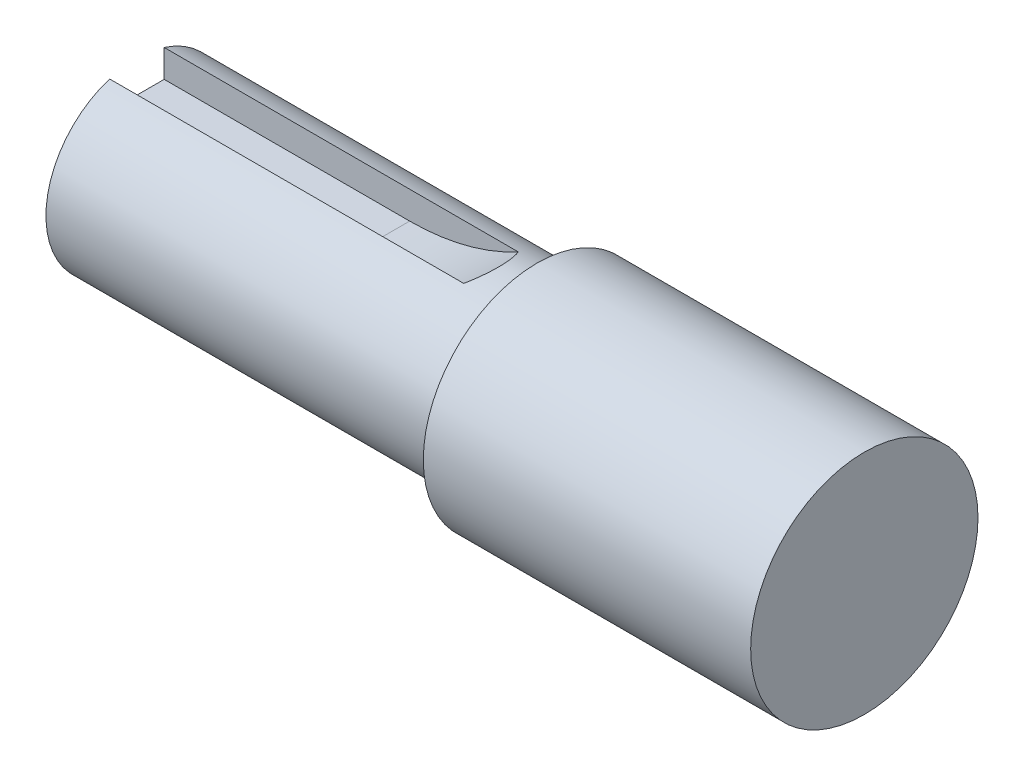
from build123d import *

# Parameters (mm, degrees)
ESQUISSE2_W             = 6
ESQUISSE2_H             = 3.5
ENL_V_MAT_EXTRU_1_DEPTH = 27
ESQUISSE3_R             = 25
ENL_V_MAT_EXTRU_2_DEPTH = 6
PER_AGE1_D              = 6.8
PER_AGE1_DEPTH          = 36
PER_AGE1_CBORE_D        = 8
PER_AGE1_CBORE_DEPTH    = 30
PER_AGE1_TIP            = 2.042926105


with BuildPart() as part:
    # Esquisse1 → Base-R_volution (revolve)
    with BuildSketch(Plane.XY, mode=Mode.PRIVATE) as base_r_volution_sk:
        Polygon((0, 12.5), (36, 12.5), (36, 0), (-44, 0), (-44, 10), (0, 10), align=None)
    revolve(base_r_volution_sk.sketch.rotate(Axis((-70, 0, 0), (1, 0, 0)), 90), axis=Axis((-70, 0, 0), (1, 0, 0)))

    # Esquisse2 → Enl_v. mat.-Extru.1 (cut)
    with BuildSketch(Plane.ZY.offset(44)):
        with Locations((0, 8.25)):
            Rectangle(ESQUISSE2_W, ESQUISSE2_H)
    extrude(amount=-ENL_V_MAT_EXTRU_1_DEPTH, mode=Mode.SUBTRACT)

    # Esquisse3 → Enl_v. mat.-Extru.2 (cut)
    with BuildSketch(Plane.XY.offset(-3)):
        with Locations((-17, 31.5)):
            Circle(ESQUISSE3_R)
    extrude(amount=ENL_V_MAT_EXTRU_2_DEPTH, mode=Mode.SUBTRACT)

    # Per_age1
    with Locations(Plane.ZY.offset(44)):
        with Locations((0, 0)):
            CounterBoreHole(PER_AGE1_D / 2, PER_AGE1_CBORE_D / 2, PER_AGE1_CBORE_DEPTH, depth=PER_AGE1_DEPTH)
            with Locations((0, 0, -(PER_AGE1_DEPTH + PER_AGE1_TIP / 2))):  # 118° drill point
                Cone(0, PER_AGE1_D / 2, PER_AGE1_TIP, mode=Mode.SUBTRACT)


solid = part.part
